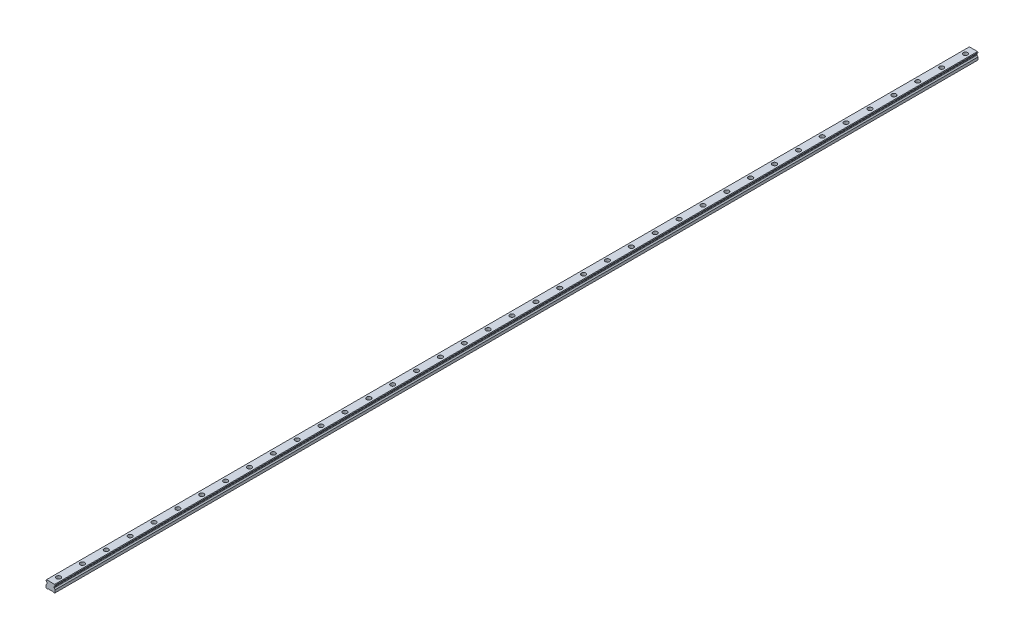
from build123d import *

# Parameters (mm, degrees)
SKETCH1_W           = 23
SKETCH1_H           = 19.2
BOSS_EXTRUDE1_DEPTH = 1160
CUT_EXTRUDE1_DEPTH  = 2321.10794792
CHAMFER1_SIZE       = 1.25
FILLET1_R           = 1.25
CUT_EXTRUDE2_DEPTH  = 2321.10794792
SKETCH4_R           = 5.5
SKETCH4_R_2         = 3.5
CUT_EXTRUDE3_DEPTH  = 9
SKETCH4_2_R         = 3.5
CUT_EXTRUDE4_DEPTH  = 1161.215880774
LPATTERN1_COUNT     = 39
LPATTERN1_PITCH     = 60


with BuildPart() as part:
    # Sketch1 → Boss-Extrude1 (new, symmetric)
    with BuildSketch(Plane.XY):
        with Locations((0, 9.6)):
            Rectangle(SKETCH1_W, SKETCH1_H)
    extrude(amount=BOSS_EXTRUDE1_DEPTH, both=True)

    # Sketch2 → Cut-Extrude1 (cut, through all)
    with BuildSketch(Plane.XY.offset(1160)):
        Polygon((-11.5, 16.7), (-11.5, 7.95), (-8.583333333, 10.866666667), (-8.583333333, 13.783333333), align=None)
        Polygon((8.583333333, 13.783333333), (11.5, 16.7), (11.5, 7.95), (8.583333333, 10.866666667), align=None)
    extrude(amount=-CUT_EXTRUDE1_DEPTH, mode=Mode.SUBTRACT)

    # Chamfer1
    chamfer1_edges = [part.edges().sort_by_distance(p)[0] for p in [
        (-11.5, 19.2, 0),
        (11.5, 19.2, 0),
        (11.5, 0, 0),
        (-11.5, 0, 0),
    ]]
    chamfer(chamfer1_edges, length=CHAMFER1_SIZE)

    # Fillet1
    fillet1_edges = [part.edges().sort_by_distance(p)[0] for p in [
        (-8.583333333, 13.783333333, 0),
        (-8.583333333, 10.866666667, 0),
        (8.583333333, 10.866666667, 0),
        (8.583333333, 13.783333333, 0),
    ]]
    fillet(fillet1_edges, radius=FILLET1_R)

    # Sketch3 → Cut-Extrude2 (cut, through all)
    with BuildSketch(Plane.XY.offset(1160)):
        Polygon((-7, 0), (-5.75, 1.25), (5.75, 1.25), (7, 0), align=None)
    extrude(amount=-CUT_EXTRUDE2_DEPTH, mode=Mode.SUBTRACT)

    # Sketch4 → Cut-Extrude3 (cut)
    with BuildSketch(Plane(origin=(0, 19.2, 0), x_dir=(1, 0, 0), z_dir=(0, 1, 0))):
        with Locations(Location((0, -1140, 0), (0, 0, 270))):
            Circle(SKETCH4_R)
        with Locations(Location((0, -1140, 0), (0, 0, 270))):
            Circle(SKETCH4_R_2, mode=Mode.SUBTRACT)
    cut_extrude3 = extrude(amount=-CUT_EXTRUDE3_DEPTH, mode=Mode.SUBTRACT)

    # Sketch4_2 → Cut-Extrude4 (cut, through all)
    with BuildSketch(Plane(origin=(0, 19.2, 0), x_dir=(1, 0, 0), z_dir=(0, 1, 0))):
        with Locations(Location((0, -1140, 0), (0, 0, 270))):
            Circle(SKETCH4_2_R)
    cut_extrude4 = extrude(amount=-CUT_EXTRUDE4_DEPTH, mode=Mode.SUBTRACT)

    # LPattern1: Cut-Extrude3, Cut-Extrude4 ×39
    with Locations(*[(0, 0, -i * LPATTERN1_PITCH) for i in range(1, LPATTERN1_COUNT)]):
        add(cut_extrude3, mode=Mode.SUBTRACT)
        add(cut_extrude4, mode=Mode.SUBTRACT)


solid = part.part
